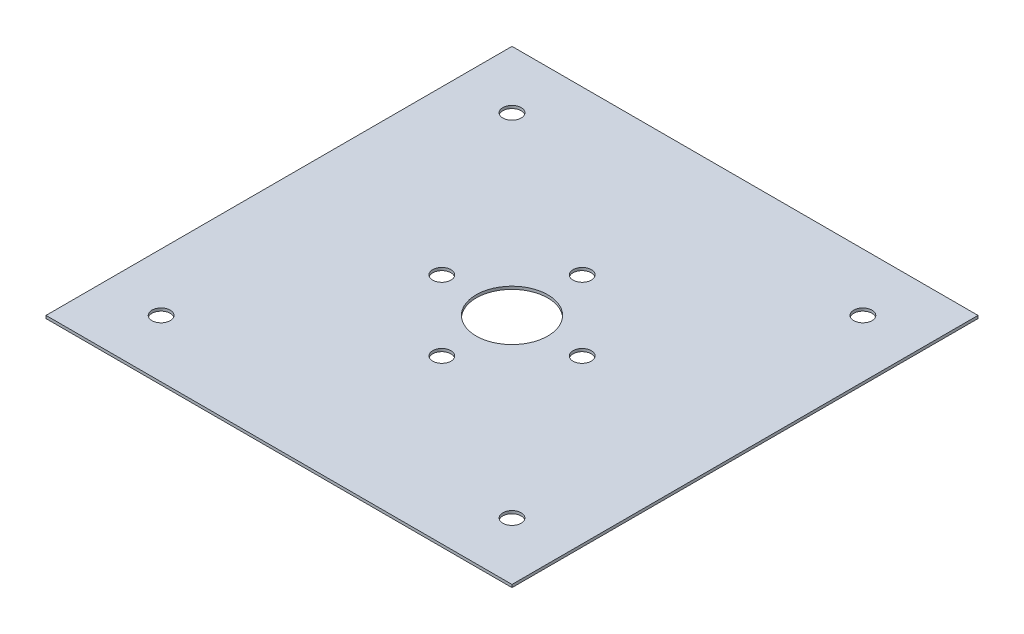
from build123d import *

# Parameters (mm, degrees)
SKETCH1_W           = 332
SKETCH1_H           = 332
SKETCH1_R           = 6.5
SKETCH1_R_2         = 25.5
BOSS_EXTRUDE1_DEPTH = 2


with BuildPart() as part:
    # Sketch1 → Boss-Extrude1 (new body)
    with BuildSketch(Plane(origin=(0, 0, 0), x_dir=(1, 0, 0), z_dir=(0, 1, 0))):
        Rectangle(SKETCH1_W, SKETCH1_H)
        with Locations(Location((-125, 125, 0), (0, 0, 270))):
            Circle(SKETCH1_R, mode=Mode.SUBTRACT)
        with Locations(Location((125, 125, 0), (0, 0, 90))):
            Circle(SKETCH1_R, mode=Mode.SUBTRACT)
        with Locations(Location((125, -125, 0), (0, 0, 270))):
            Circle(SKETCH1_R, mode=Mode.SUBTRACT)
        with Locations(Location((-125, -125, 0), (0, 0, 90))):
            Circle(SKETCH1_R, mode=Mode.SUBTRACT)
        with Locations(Location((0, 0, 0), (0, 0, 270))):
            Circle(SKETCH1_R_2, mode=Mode.SUBTRACT)
        with Locations(Location((-50, 0, 0), (0, 0, 270))):
            Circle(SKETCH1_R, mode=Mode.SUBTRACT)
        with Locations(Location((0, 50, 0), (0, 0, 270))):
            Circle(SKETCH1_R, mode=Mode.SUBTRACT)
        with Locations(Location((50, 0, 0), (0, 0, 270))):
            Circle(SKETCH1_R, mode=Mode.SUBTRACT)
        with Locations(Location((0, -50, 0), (0, 0, 270))):
            Circle(SKETCH1_R, mode=Mode.SUBTRACT)
    extrude(amount=BOSS_EXTRUDE1_DEPTH)


solid = part.part
